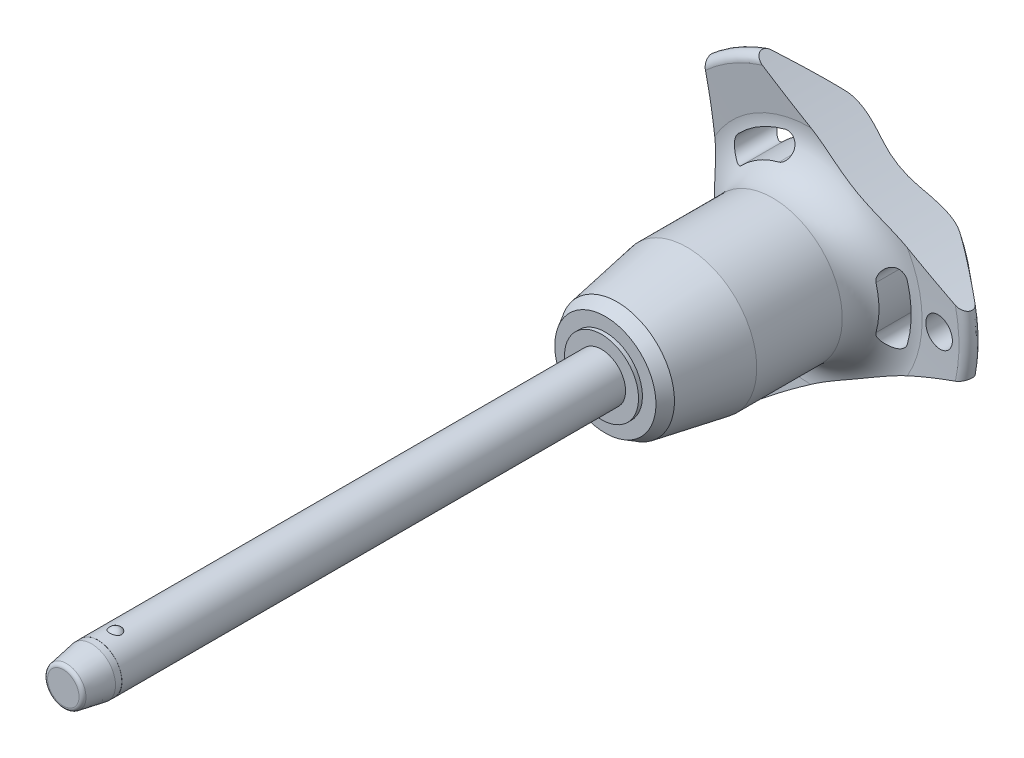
from build123d import *

# Parameters (mm, degrees)
SKETCH1_R           = 2.5
BOSS_EXTRUDE1_DEPTH = 50
SKETCH2_R           = 2.1
BOSS_EXTRUDE2_DEPTH = 26.7
BOSS_EXTRUDE3_START = 6
SKETCH1_2_R         = 2.5
BOSS_EXTRUDE3_DEPTH = 6
CHAMFER1_SIZE       = 3
CHAMFER1_SIZE2      = 0.528980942
FILLET1_R           = 0.4
SKETCH6_R           = 79.96
CUT_EXTRUDE1_DEPTH  = 81.212991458
CIRPATTERN1_COUNT   = 3
SKETCH7_R           = 1.5
CUT_EXTRUDE2_DEPTH  = 81.023009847
SKETCH8_R           = 2.5
SKETCH8_R_2         = 2.49
CUT_EXTRUDE3_DEPTH  = 3.6


with BuildPart() as part:
    # Sketch1 → Boss-Extrude1 (new body)
    with BuildSketch(Plane.XY):
        Circle(SKETCH1_R)
    extrude(amount=-BOSS_EXTRUDE1_DEPTH)

    # Sketch2 → Boss-Extrude2 (add)
    with BuildSketch(Plane(origin=(0, 0, -50), x_dir=(-1, 0, 0), z_dir=(0, 0, -1))):
        Circle(SKETCH2_R)
    extrude(amount=BOSS_EXTRUDE2_DEPTH)

    # Sketch3 → Revolve1 (revolve)
    with BuildSketch(Plane(origin=(0, 0, 0), x_dir=(0, 0, -1), z_dir=(1, 0, 0))):
        with BuildLine():
            Line((-0.580947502, 2.75), (-0.580947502, 1.15))
            ThreePointArc((-0.580947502, 1.15), (0.219052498, 1.95), (-0.580947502, 2.75))
        make_face()
        with BuildLine():
            Line((-0.580947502, -1.15), (-0.580947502, -2.75))
            ThreePointArc((-0.580947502, -2.75), (0.219052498, -1.95), (-0.580947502, -1.15))
        make_face()
    revolve(axis=Axis((0, -1.15, 0.580947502), (0, 1, 0)))

    # Sketch1_2 → Boss-Extrude3 (add)
    with BuildSketch(Plane.XY.offset(BOSS_EXTRUDE3_START)):
        Circle(SKETCH1_2_R)
    extrude(amount=-BOSS_EXTRUDE3_DEPTH)

    # Chamfer1
    chamfer1_edges = [part.edges().sort_by_distance(p)[0] for p in [
        (-2.5, 0, 6),
    ]]
    chamfer1_side = [part.faces().sort_by_distance(p)[0] for p in [
        (-2.5, 0, -22),
    ]]
    chamfer(chamfer1_edges, length=CHAMFER1_SIZE, length2=CHAMFER1_SIZE2, reference=chamfer1_side[0])

    # Fillet1
    fillet1_edges = [part.edges().sort_by_distance(p)[0] for p in [
        (-1.971019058, 0, 6),
        (2.1, 0, -76.7),
    ]]
    fillet(fillet1_edges, radius=FILLET1_R)

    # Sketch4 → Revolve2 (revolve)
    with BuildSketch(Plane(origin=(0, 0, 0), x_dir=(0, 0, -1), z_dir=(1, 0, 0)), mode=Mode.PRIVATE) as revolve2_sk:
        Polygon((50, 0), (50, 3.851837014), (50.4, 3.851837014), (50.4, 5.26161122), (51.620900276, 5.966498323), (58.9, 7.25), (67.8, 7.25), (67.8, 0), align=None)
    revolve(revolve2_sk.sketch.rotate(Axis((0, 0, -67.8), (0, 0, 1)), 90), axis=Axis((0, 0, -67.8), (0, 0, 1)))

    # Sketch5 → Revolve3 (revolve)
    with BuildSketch(Plane(origin=(0, 0, 0), x_dir=(0, 0, -1), z_dir=(1, 0, 0)), mode=Mode.PRIVATE) as revolve3_sk:
        with BuildLine():
            Line((71.78715932, 11.570250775), (71.452568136, 15.735949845))
            ThreePointArc((71.452568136, 15.735949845), (71.946485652, 16.540188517), (72.862835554, 16.314230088))
            Line((72.862835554, 16.314230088), (76.326414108, 12.186497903))
            ThreePointArc((76.326414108, 12.186497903), (76.7, 11.109282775), (76.261488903, 10.056825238))
            ThreePointArc((76.261488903, 10.056825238), (73.289873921, 5.413681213), (72.25, 0))
            Line((72.25, 0), (67.8, 0))
            Line((67.8, 0), (67.8, 7.25))
            ThreePointArc((67.8, 7.25), (70.739473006, 8.537160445), (71.78715932, 11.570250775))
        make_face()
    revolve(revolve3_sk.sketch.rotate(Axis((0, 0, -72.25), (0, 0, 1)), 90), axis=Axis((0, 0, -72.25), (0, 0, 1)))

    # Sketch6 → Cut-Extrude1 (cut, through all)
    with BuildSketch(Plane.XY):
        with Locations((-89.76, 0)):
            Circle(SKETCH6_R)
        with BuildLine():
            ThreePointArc((10.099921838, -2.834717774), (10.490188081, 0), (10.099921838, 2.834717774))
            ThreePointArc((10.099921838, 2.834717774), (8.768180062, 3.582738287), (8.020159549, 2.250996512))
            ThreePointArc((8.020159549, 2.250996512), (8.330062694, 0), (8.020159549, -2.250996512))
            ThreePointArc((8.020159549, -2.250996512), (8.768180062, -3.582738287), (10.099921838, -2.834717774))
        make_face()
    cut_extrude1 = extrude(amount=-CUT_EXTRUDE1_DEPTH, mode=Mode.SUBTRACT)

    # CirPattern1: Cut-Extrude1 ×3 about axis
    cirpattern1_axis = Axis((0, 0, 0), (0, 0, 1))
    for i in range(1, CIRPATTERN1_COUNT):
        add(cut_extrude1.rotate(cirpattern1_axis, i * 360 / CIRPATTERN1_COUNT), mode=Mode.SUBTRACT)

    # Sketch7 → Cut-Extrude2 (cut, through all)
    with BuildSketch(Plane.XY):
        with Locations(Location((13.490188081, 0, 0), (0, 0, 225.221865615))):
            Circle(SKETCH7_R)
    extrude(amount=-CUT_EXTRUDE2_DEPTH, mode=Mode.SUBTRACT)

    # Sketch8 → Cut-Extrude3 (cut)
    with BuildSketch(Plane.XY.offset(6)):
        Circle(SKETCH8_R)
        Circle(SKETCH8_R_2, mode=Mode.SUBTRACT)
    extrude(amount=-CUT_EXTRUDE3_DEPTH, mode=Mode.SUBTRACT)


solid = part.part
